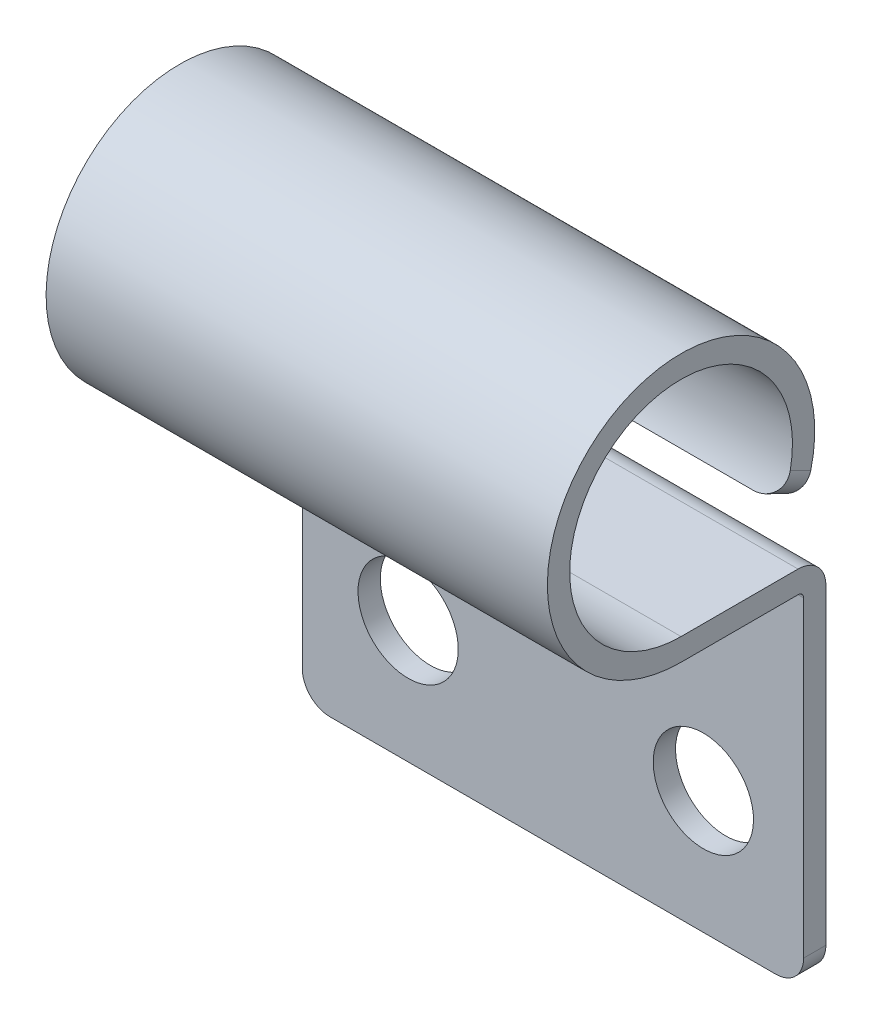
from build123d import *

# Parameters (mm, degrees)
EXTRUDE_THIN1_DEPTH = 9
SKETCH2_R           = 0.9
CUT_EXTRUDE1_DEPTH  = 14.41491707
SKETCH3_R           = 0.7
CUT_EXTRUDE2_DEPTH  = 14.41491707
FILLET1_R           = 0.5


with BuildPart() as part:
    # Sketch1 → Extrude-Thin1 (new body)
    with BuildSketch(Plane(origin=(0, 0, 0), x_dir=(0, 0, -1), z_dir=(1, 0, 0))):
        with BuildLine():
            ThreePointArc((1.797618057, -0.876680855), (-1.059867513, 1.69607808), (0, -2))
            Line((0, -2), (2.1, -2))
            ThreePointArc((2.1, -2), (2.453553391, -2.146446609), (2.6, -2.5))
            Line((2.6, -2.5), (2.6, -8.6))
            Line((2.6, -8.6), (2.2, -8.6))
            Line((2.2, -8.6), (2.2, -2.5))
            ThreePointArc((2.2, -2.5), (2.170710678, -2.429289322), (2.1, -2.4))
            Line((2.1, -2.4), (0, -2.4))
            ThreePointArc((0, -2.4), (-1.271841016, 2.035293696), (2.157141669, -1.052017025))
            Line((2.157141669, -1.052017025), (1.797618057, -0.876680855))
        make_face()
    extrude(amount=EXTRUDE_THIN1_DEPTH)

    # Sketch2 → Cut-Extrude1 (cut, through all)
    with BuildSketch(Plane(origin=(0, 0, -2.6), x_dir=(-1, 0, 0), z_dir=(0, 0, -1))):
        with Locations(Location((-1.9, -6.4, 0), (0, 0, 90))):
            Circle(SKETCH2_R)
        with Locations(Location((-7.2, -6.4, 0), (0, 0, 90))):
            Circle(SKETCH2_R)
    extrude(amount=-CUT_EXTRUDE1_DEPTH, mode=Mode.SUBTRACT)

    # Sketch3 → Cut-Extrude2 (cut, through all)
    with BuildSketch(Plane(origin=(0, 0, -2.6), x_dir=(-1, 0, 0), z_dir=(0, 0, -1))):
        with Locations(Location((-4.45, -3.7, 0), (0, 0, 90))):
            Circle(SKETCH3_R)
    extrude(amount=-CUT_EXTRUDE2_DEPTH, mode=Mode.SUBTRACT)

    # Fillet1
    fillet1_edges = [part.edges().sort_by_distance(p)[0] for p in [
        (0, -8.6, -2.4),
        (9, -0.96434894, -1.977379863),
        (9, -8.6, -2.4),
        (0, -0.96434894, -1.977379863),
    ]]
    fillet(fillet1_edges, radius=FILLET1_R)


solid = part.part
